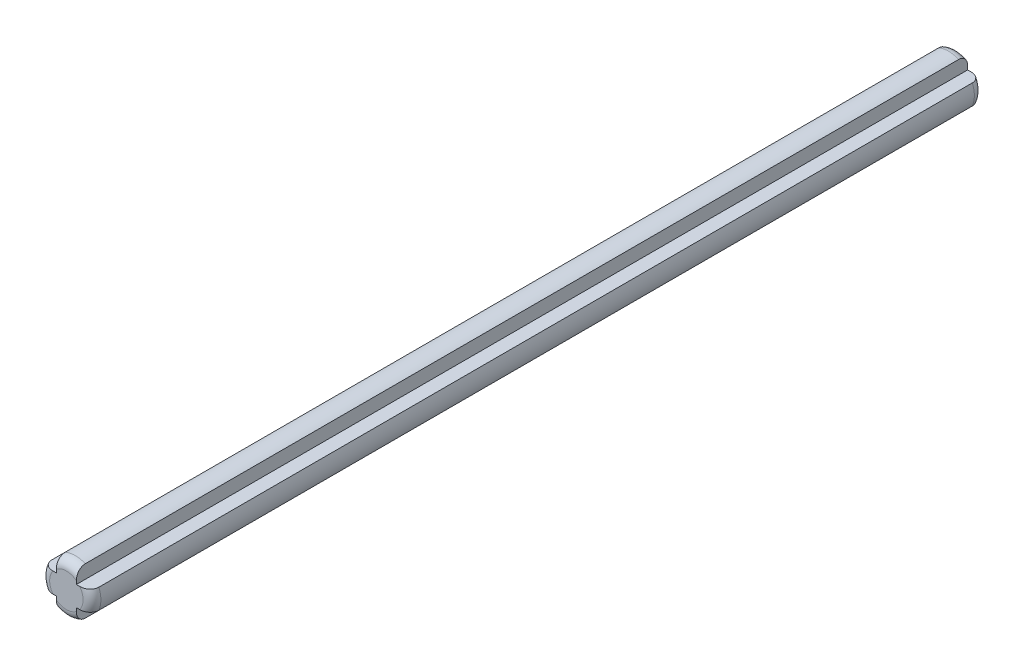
from build123d import *

# Parameters (mm, degrees)
BOSS_EXTRUDE1_DEPTH = 80
FILLET1_R           = 0.8


with BuildPart() as part:
    # Sketch1 → Boss-Extrude1 (new body)
    with BuildSketch(Plane.XY):
        with BuildLine():
            ThreePointArc((0.8999999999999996, 2.116601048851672), (1.4e-16, 2.3), (-0.8999999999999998, 2.116601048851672))
            Line((-0.8999999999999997, 2.1166010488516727), (-0.8999999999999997, 0.8999999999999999))
            Line((-0.8999999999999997, 0.9), (-2.116601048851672, 0.9))
            ThreePointArc((-2.116601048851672, 0.8999999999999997), (-2.3, 2.8e-16), (-2.1166010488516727, -0.8999999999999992))
            Line((-2.116601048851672, -0.9), (-0.8999999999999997, -0.9))
            Line((-0.8999999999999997, -0.8999999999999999), (-0.8999999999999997, -2.1166010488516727))
            ThreePointArc((-0.8999999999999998, -2.116601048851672), (-4.2e-16, -2.3), (0.899999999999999, -2.1166010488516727))
            Line((0.8999999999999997, -2.1166010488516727), (0.8999999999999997, -0.8999999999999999))
            Line((0.8999999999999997, -0.9), (2.116601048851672, -0.9))
            ThreePointArc((2.116601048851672, -0.9), (2.253683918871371, -0.4592480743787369), (2.3, -5.6e-16))
            ThreePointArc((2.3, 0), (2.2536839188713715, 0.4592480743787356), (2.116601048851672, 0.9))
            Line((2.116601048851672, 0.9), (0.8999999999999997, 0.9))
            Line((0.8999999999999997, 0.8999999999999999), (0.8999999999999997, 2.1166010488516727))
        make_face()
    extrude(amount=-BOSS_EXTRUDE1_DEPTH)

    # Fillet1
    fillet1_edges = [part.edges().sort_by_distance(p)[0] for p in [
        (-3.3e-16, 2.3, -80),
        (2.3, -3e-17, 0),
        (-5.3e-16, -2.3000000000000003, 0),
        (-2.3000000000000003, 5.8e-16, 0),
        (-3.3e-16, 2.3, 0),
        (-2.3000000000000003, 5.8e-16, -80),
        (-5.3e-16, -2.3000000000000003, -80),
        (2.3000000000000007, 7e-17, -80),
    ]]
    fillet(fillet1_edges, radius=FILLET1_R)


solid = part.part
